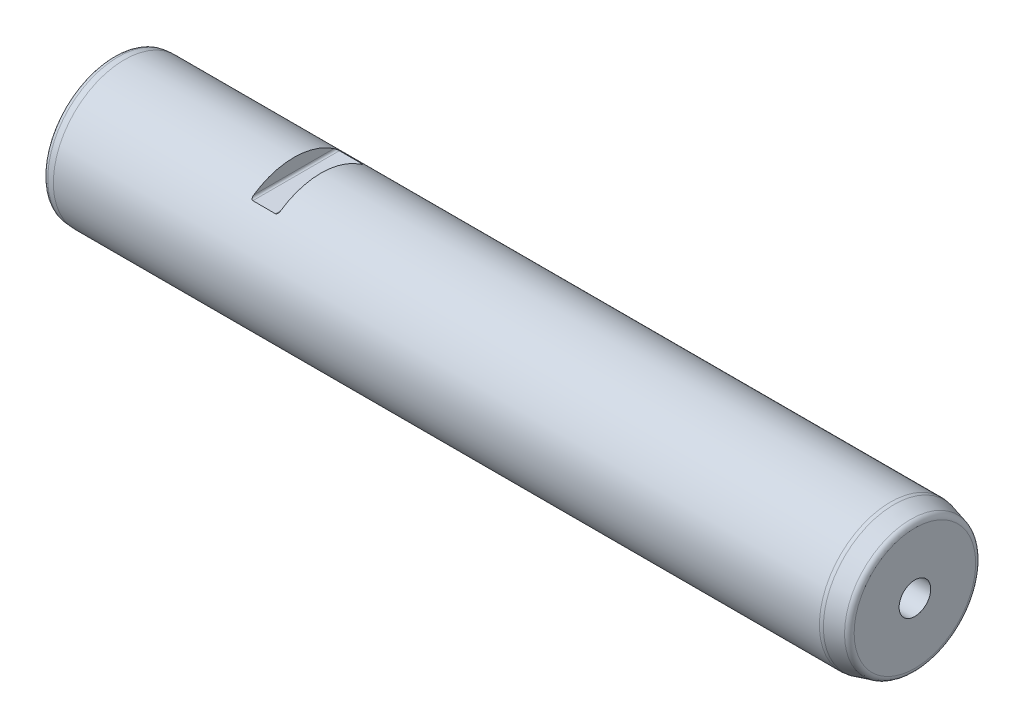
ISO-10303-21;
HEADER;
FILE_DESCRIPTION(('STEP AP214'),'2;1');
FILE_NAME('part.step','',(''),(''),'','','');
FILE_SCHEMA(('AUTOMOTIVE_DESIGN { 1 0 10303 214 1 1 1 1 }'));
ENDSEC;
DATA;
#1=APPLICATION_CONTEXT('core data for automotive mechanical design processes');
#2=APPLICATION_PROTOCOL_DEFINITION('international standard','automotive_design',2000,#1);
#3=PRODUCT_CONTEXT('',#1,'mechanical');
#4=PRODUCT('Part','Part','',(#3));
#5=PRODUCT_RELATED_PRODUCT_CATEGORY('part','',(#4));
#6=PRODUCT_DEFINITION_FORMATION('','',#4);
#7=PRODUCT_DEFINITION_CONTEXT('part definition',#1,'design');
#8=PRODUCT_DEFINITION('design','',#6,#7);
#9=PRODUCT_DEFINITION_SHAPE('','',#8);
#10=(LENGTH_UNIT() NAMED_UNIT(*) SI_UNIT(.MILLI.,.METRE.));
#11=(NAMED_UNIT(*) PLANE_ANGLE_UNIT() SI_UNIT($,.RADIAN.));
#12=(NAMED_UNIT(*) SI_UNIT($,.STERADIAN.) SOLID_ANGLE_UNIT());
#13=UNCERTAINTY_MEASURE_WITH_UNIT(LENGTH_MEASURE(1.E-05),#10,'distance_accuracy_value','');
#14=(GEOMETRIC_REPRESENTATION_CONTEXT(3) GLOBAL_UNCERTAINTY_ASSIGNED_CONTEXT((#13)) GLOBAL_UNIT_ASSIGNED_CONTEXT((#10,
#11,#12)) REPRESENTATION_CONTEXT('',''));
#15=CARTESIAN_POINT('',(0.,0.,0.));
#16=DIRECTION('',(0.,0.,1.));
#17=DIRECTION('',(1.,0.,0.));
#18=AXIS2_PLACEMENT_3D('',#15,#16,#17);
#19=CARTESIAN_POINT('',(0.,0.,0.));
#20=DIRECTION('',(1.,0.,0.));
#21=DIRECTION('',(0.,0.,-1.));
#22=AXIS2_PLACEMENT_3D('',#19,#20,#21);
#23=PLANE('',#22);
#24=CARTESIAN_POINT('',(0.,0.,0.));
#25=DIRECTION('',(1.,0.,0.));
#26=DIRECTION('',(0.,0.,-1.));
#27=AXIS2_PLACEMENT_3D('',#24,#25,#26);
#28=CIRCLE('',#27,28.7717287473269);
#29=CARTESIAN_POINT('',(0.,0.,-28.7717287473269));
#30=VERTEX_POINT('',#29);
#31=EDGE_CURVE('E160',#30,#30,#28,.F.);
#32=ORIENTED_EDGE('',*,*,#31,.T.);
#33=EDGE_LOOP('',(#32));
#34=FACE_BOUND('',#33,.T.);
#35=ADVANCED_FACE('F15',(#34),#23,.F.);
#36=CARTESIAN_POINT('',(0.,0.,0.));
#37=DIRECTION('',(-1.,0.,0.));
#38=DIRECTION('',(0.,0.,1.));
#39=AXIS2_PLACEMENT_3D('',#36,#37,#38);
#40=CYLINDRICAL_SURFACE('',#39,31.5);
#41=CARTESIAN_POINT('',(91.,25.,-19.1637678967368));
#42=CARTESIAN_POINT('',(91.0206021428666,24.9999962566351,-19.1637724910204));
#43=CARTESIAN_POINT('',(91.0411895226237,25.000637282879,-19.1629365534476));
#44=CARTESIAN_POINT('',(91.0821323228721,25.0031684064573,-19.1596340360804));
#45=CARTESIAN_POINT('',(91.1024879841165,25.0050570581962,-19.1571693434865));
#46=CARTESIAN_POINT('',(91.1624864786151,25.0124756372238,-19.1474836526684));
#47=CARTESIAN_POINT('',(91.2015690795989,25.0197603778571,-19.1379682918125));
#48=CARTESIAN_POINT('',(91.2768030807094,25.0382921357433,-19.1137163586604));
#49=CARTESIAN_POINT('',(91.3129662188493,25.0495222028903,-19.0990021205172));
#50=CARTESIAN_POINT('',(91.3821411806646,25.0751576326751,-19.0653329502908));
#51=CARTESIAN_POINT('',(91.4151429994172,25.0895726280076,-19.0463651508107));
#52=CARTESIAN_POINT('',(91.4940924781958,25.1289598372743,-18.9943915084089));
#53=CARTESIAN_POINT('',(91.5378167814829,25.1555174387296,-18.9592231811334));
#54=CARTESIAN_POINT('',(91.6178752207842,25.2121909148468,-18.8837940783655));
#55=CARTESIAN_POINT('',(91.654194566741,25.2423137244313,-18.8435233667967));
#56=CARTESIAN_POINT('',(91.7400427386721,25.323512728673,-18.7343708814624));
#57=CARTESIAN_POINT('',(91.7844613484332,25.3763362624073,-18.6627946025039));
#58=CARTESIAN_POINT('',(91.8595737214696,25.4847393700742,-18.5144966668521));
#59=CARTESIAN_POINT('',(91.8902090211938,25.5403295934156,-18.437754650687));
#60=CARTESIAN_POINT('',(91.9297784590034,25.6300581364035,-18.3126586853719));
#61=CARTESIAN_POINT('',(91.9424916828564,25.6638849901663,-18.2652250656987));
#62=CARTESIAN_POINT('',(91.963993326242,25.7317021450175,-18.1695608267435));
#63=CARTESIAN_POINT('',(91.9727802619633,25.7656925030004,-18.121329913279));
#64=CARTESIAN_POINT('',(91.9865826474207,25.8331875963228,-18.0249779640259));
#65=CARTESIAN_POINT('',(91.9916469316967,25.866692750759,-17.9768640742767));
#66=CARTESIAN_POINT('',(91.9983485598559,25.9335124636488,-17.8803351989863));
#67=CARTESIAN_POINT('',(91.9999892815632,25.9668271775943,-17.8319205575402));
#68=CARTESIAN_POINT('',(92.,26.,-17.7834192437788));
#69=B_SPLINE_CURVE_WITH_KNOTS('',3,(#41,#42,#43,#44,#45,#46,#47,#48,#49,#50,#51,#52,#53,#54,#55,
#56,#57,#58,#59,#60,#61,#62,#63,#64,#65,#66,#67,#68),.UNSPECIFIED.,.F.,.F.,(4,2,2,2,2,2,2,2,2,2,
2,2,2,4),(0.,0.0617521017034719,0.123432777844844,0.245296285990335,0.366642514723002,
0.488360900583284,0.673551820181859,0.859109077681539,1.15576169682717,1.45366100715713,
1.63242917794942,1.81126485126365,1.98771047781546,2.16398193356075),.UNSPECIFIED.);
#70=CARTESIAN_POINT('',(91.,25.,-19.1637678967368));
#71=VERTEX_POINT('',#70);
#72=CARTESIAN_POINT('',(92.,26.,-17.7834192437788));
#73=VERTEX_POINT('',#72);
#74=EDGE_CURVE('E206',#71,#73,#69,.T.);
#75=ORIENTED_EDGE('',*,*,#74,.T.);
#76=CARTESIAN_POINT('',(92.,0.,0.));
#77=DIRECTION('',(1.,0.,0.));
#78=DIRECTION('',(0.,0.,-1.));
#79=AXIS2_PLACEMENT_3D('',#76,#77,#78);
#80=CIRCLE('',#79,31.5);
#81=CARTESIAN_POINT('',(92.,26.,17.7834192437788));
#82=VERTEX_POINT('',#81);
#83=EDGE_CURVE('E9',#73,#82,#80,.T.);
#84=ORIENTED_EDGE('',*,*,#83,.T.);
#85=CARTESIAN_POINT('',(92.,26.,17.7834192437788));
#86=CARTESIAN_POINT('',(91.9999572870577,25.9536837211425,17.8511416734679));
#87=CARTESIAN_POINT('',(91.9967773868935,25.9070697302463,17.9187190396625));
#88=CARTESIAN_POINT('',(91.98359435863,25.8134163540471,18.0533717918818));
#89=CARTESIAN_POINT('',(91.9735592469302,25.7663759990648,18.1204433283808));
#90=CARTESIAN_POINT('',(91.9459716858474,25.672018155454,18.2538828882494));
#91=CARTESIAN_POINT('',(91.9283458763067,25.6247025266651,18.3202373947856));
#92=CARTESIAN_POINT('',(91.8846961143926,25.5309760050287,18.450628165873));
#93=CARTESIAN_POINT('',(91.8586908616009,25.4845633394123,18.5146692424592));
#94=CARTESIAN_POINT('',(91.8035708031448,25.4032208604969,18.6260588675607));
#95=CARTESIAN_POINT('',(91.7762945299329,25.3679487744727,18.6740601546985));
#96=CARTESIAN_POINT('',(91.7149053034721,25.2992635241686,18.7670081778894));
#97=CARTESIAN_POINT('',(91.6807928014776,25.2658502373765,18.8119551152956));
#98=CARTESIAN_POINT('',(91.6042482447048,25.2016125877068,18.8979268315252));
#99=CARTESIAN_POINT('',(91.5617053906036,25.1708315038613,18.9388871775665));
#100=CARTESIAN_POINT('',(91.4677411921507,25.1144557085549,19.0135816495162));
#101=CARTESIAN_POINT('',(91.4163575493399,25.0888399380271,19.0473451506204));
#102=CARTESIAN_POINT('',(91.3286773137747,25.0549354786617,19.0918997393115));
#103=CARTESIAN_POINT('',(91.2952896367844,25.0439158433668,19.1063475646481));
#104=CARTESIAN_POINT('',(91.2260723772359,25.0252341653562,19.1308099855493));
#105=CARTESIAN_POINT('',(91.1902489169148,25.0175640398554,19.1408352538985));
#106=CARTESIAN_POINT('',(91.1285741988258,25.0079765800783,19.1533587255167));
#107=CARTESIAN_POINT('',(91.1031595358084,25.0050065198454,19.1572353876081));
#108=CARTESIAN_POINT('',(91.0518392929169,25.001008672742,19.1624520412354));
#109=CARTESIAN_POINT('',(91.0259323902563,24.9999872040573,19.1637837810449));
#110=CARTESIAN_POINT('',(91.,25.,19.1637678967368));
#111=B_SPLINE_CURVE_WITH_KNOTS('',3,(#85,#86,#87,#88,#89,#90,#91,#92,#93,#94,#95,#96,#97,#98,
#99,#100,#101,#102,#103,#104,#105,#106,#107,#108,#109,#110),.UNSPECIFIED.,.F.,.F.,(4,2,2,2,2,2,
2,2,2,2,2,2,4),(0.,0.2461520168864,0.493460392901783,0.743214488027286,0.992415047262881,
1.18859975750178,1.38477152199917,1.58371665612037,1.78183351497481,1.8954759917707,
2.00884269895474,2.0862906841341,2.16398936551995),.UNSPECIFIED.);
#112=CARTESIAN_POINT('',(91.,25.,19.1637678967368));
#113=VERTEX_POINT('',#112);
#114=EDGE_CURVE('E23',#82,#113,#111,.T.);
#115=ORIENTED_EDGE('',*,*,#114,.T.);
#116=DIRECTION('',(-1.,0.,0.));
#117=VECTOR('',#116,1.);
#118=CARTESIAN_POINT('',(0.,25.,19.1637678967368));
#119=LINE('',#118,#117);
#120=CARTESIAN_POINT('',(81.,25.,19.1637678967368));
#121=VERTEX_POINT('',#120);
#122=EDGE_CURVE('E74',#113,#121,#119,.T.);
#123=ORIENTED_EDGE('',*,*,#122,.T.);
#124=CARTESIAN_POINT('',(81.,25.,19.1637678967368));
#125=CARTESIAN_POINT('',(80.9793978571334,24.9999962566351,19.1637724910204));
#126=CARTESIAN_POINT('',(80.9588104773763,25.000637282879,19.1629365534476));
#127=CARTESIAN_POINT('',(80.9178676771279,25.0031684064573,19.1596340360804));
#128=CARTESIAN_POINT('',(80.8975120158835,25.0050570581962,19.1571693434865));
#129=CARTESIAN_POINT('',(80.8375135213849,25.0124756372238,19.1474836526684));
#130=CARTESIAN_POINT('',(80.7984309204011,25.0197603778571,19.1379682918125));
#131=CARTESIAN_POINT('',(80.7231969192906,25.0382921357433,19.1137163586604));
#132=CARTESIAN_POINT('',(80.6870337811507,25.0495222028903,19.0990021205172));
#133=CARTESIAN_POINT('',(80.6178588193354,25.0751576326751,19.0653329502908));
#134=CARTESIAN_POINT('',(80.5848570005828,25.0895726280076,19.0463651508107));
#135=CARTESIAN_POINT('',(80.5059075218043,25.1289598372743,18.9943915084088));
#136=CARTESIAN_POINT('',(80.4621832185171,25.1555174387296,18.9592231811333));
#137=CARTESIAN_POINT('',(80.3821247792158,25.2121909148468,18.8837940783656));
#138=CARTESIAN_POINT('',(80.345805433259,25.2423137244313,18.8435233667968));
#139=CARTESIAN_POINT('',(80.2599572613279,25.3235127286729,18.7343708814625));
#140=CARTESIAN_POINT('',(80.2155386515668,25.3763362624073,18.662794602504));
#141=CARTESIAN_POINT('',(80.1404262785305,25.4847393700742,18.5144966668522));
#142=CARTESIAN_POINT('',(80.1097909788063,25.5403295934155,18.437754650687));
#143=CARTESIAN_POINT('',(80.0702215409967,25.6300581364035,18.3126586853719));
#144=CARTESIAN_POINT('',(80.0575083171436,25.6638849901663,18.2652250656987));
#145=CARTESIAN_POINT('',(80.0360066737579,25.7317021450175,18.1695608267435));
#146=CARTESIAN_POINT('',(80.0272197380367,25.7656925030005,18.121329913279));
#147=CARTESIAN_POINT('',(80.0134173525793,25.8331875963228,18.0249779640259));
#148=CARTESIAN_POINT('',(80.0083530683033,25.866692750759,17.9768640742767));
#149=CARTESIAN_POINT('',(80.0016514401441,25.9335124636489,17.8803351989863));
#150=CARTESIAN_POINT('',(80.0000107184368,25.9668271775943,17.8319205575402));
#151=CARTESIAN_POINT('',(80.,26.,17.7834192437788));
#152=B_SPLINE_CURVE_WITH_KNOTS('',3,(#124,#125,#126,#127,#128,#129,#130,#131,#132,#133,#134,
#135,#136,#137,#138,#139,#140,#141,#142,#143,#144,#145,#146,#147,#148,#149,#150,#151),
.UNSPECIFIED.,.F.,.F.,(4,2,2,2,2,2,2,2,2,2,2,2,2,4),(0.,0.061752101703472,0.123432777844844,
0.245296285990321,0.366642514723,0.488360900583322,0.673551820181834,0.859109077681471,
1.15576169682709,1.45366100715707,1.6324291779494,1.81126485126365,1.98771047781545,
2.16398193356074),.UNSPECIFIED.);
#153=CARTESIAN_POINT('',(80.,26.,17.7834192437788));
#154=VERTEX_POINT('',#153);
#155=EDGE_CURVE('E65',#121,#154,#152,.T.);
#156=ORIENTED_EDGE('',*,*,#155,.T.);
#157=CARTESIAN_POINT('',(80.,0.,0.));
#158=DIRECTION('',(-1.,0.,0.));
#159=DIRECTION('',(0.,-1.,0.));
#160=AXIS2_PLACEMENT_3D('',#157,#158,#159);
#161=CIRCLE('',#160,31.5);
#162=CARTESIAN_POINT('',(80.,26.,-17.7834192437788));
#163=VERTEX_POINT('',#162);
#164=EDGE_CURVE('E54',#154,#163,#161,.T.);
#165=ORIENTED_EDGE('',*,*,#164,.T.);
#166=CARTESIAN_POINT('',(80.,26.,-17.7834192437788));
#167=CARTESIAN_POINT('',(80.0000427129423,25.9536837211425,-17.8511416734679));
#168=CARTESIAN_POINT('',(80.0032226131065,25.9070697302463,-17.9187190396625));
#169=CARTESIAN_POINT('',(80.01640564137,25.8134163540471,-18.0533717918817));
#170=CARTESIAN_POINT('',(80.0264407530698,25.7663759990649,-18.1204433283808));
#171=CARTESIAN_POINT('',(80.0540283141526,25.672018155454,-18.2538828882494));
#172=CARTESIAN_POINT('',(80.0716541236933,25.6247025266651,-18.3202373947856));
#173=CARTESIAN_POINT('',(80.1153038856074,25.5309760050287,-18.450628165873));
#174=CARTESIAN_POINT('',(80.1413091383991,25.4845633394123,-18.5146692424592));
#175=CARTESIAN_POINT('',(80.1964291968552,25.4032208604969,-18.6260588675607));
#176=CARTESIAN_POINT('',(80.2237054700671,25.3679487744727,-18.6740601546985));
#177=CARTESIAN_POINT('',(80.2850946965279,25.2992635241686,-18.7670081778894));
#178=CARTESIAN_POINT('',(80.3192071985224,25.2658502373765,-18.8119551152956));
#179=CARTESIAN_POINT('',(80.3957517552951,25.2016125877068,-18.8979268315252));
#180=CARTESIAN_POINT('',(80.4382946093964,25.1708315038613,-18.9388871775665));
#181=CARTESIAN_POINT('',(80.5322588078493,25.1144557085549,-19.0135816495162));
#182=CARTESIAN_POINT('',(80.5836424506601,25.0888399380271,-19.0473451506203));
#183=CARTESIAN_POINT('',(80.6713226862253,25.0549354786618,-19.0918997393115));
#184=CARTESIAN_POINT('',(80.7047103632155,25.0439158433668,-19.106347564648));
#185=CARTESIAN_POINT('',(80.7739276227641,25.0252341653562,-19.1308099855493));
#186=CARTESIAN_POINT('',(80.8097510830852,25.0175640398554,-19.1408352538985));
#187=CARTESIAN_POINT('',(80.8714258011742,25.0079765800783,-19.1533587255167));
#188=CARTESIAN_POINT('',(80.8968404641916,25.0050065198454,-19.1572353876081));
#189=CARTESIAN_POINT('',(80.9481607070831,25.001008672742,-19.1624520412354));
#190=CARTESIAN_POINT('',(80.9740676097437,24.9999872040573,-19.1637837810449));
#191=CARTESIAN_POINT('',(81.,25.,-19.1637678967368));
#192=B_SPLINE_CURVE_WITH_KNOTS('',3,(#166,#167,#168,#169,#170,#171,#172,#173,#174,#175,#176,
#177,#178,#179,#180,#181,#182,#183,#184,#185,#186,#187,#188,#189,#190,#191),.UNSPECIFIED.,.F.,
.F.,(4,2,2,2,2,2,2,2,2,2,2,2,4),(0.,0.246152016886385,0.493460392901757,0.743214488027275,
0.992415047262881,1.18859975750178,1.38477152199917,1.58371665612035,1.78183351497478,
1.89547599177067,2.00884269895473,2.08629068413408,2.16398936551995),.UNSPECIFIED.);
#193=CARTESIAN_POINT('',(81.,25.,-19.1637678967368));
#194=VERTEX_POINT('',#193);
#195=EDGE_CURVE('E59',#163,#194,#192,.T.);
#196=ORIENTED_EDGE('',*,*,#195,.T.);
#197=DIRECTION('',(-1.,0.,0.));
#198=VECTOR('',#197,1.);
#199=CARTESIAN_POINT('',(0.,25.,-19.1637678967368));
#200=LINE('',#199,#198);
#201=EDGE_CURVE('E75',#194,#71,#200,.F.);
#202=ORIENTED_EDGE('',*,*,#201,.T.);
#203=EDGE_LOOP('',(#75,#84,#115,#123,#156,#165,#196,#202));
#204=FACE_BOUND('',#203,.T.);
#205=CARTESIAN_POINT('',(4.99999999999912,0.,0.));
#206=DIRECTION('',(1.,0.,0.));
#207=DIRECTION('',(0.,0.,-1.));
#208=AXIS2_PLACEMENT_3D('',#205,#206,#207);
#209=CIRCLE('',#208,31.5);
#210=CARTESIAN_POINT('',(4.99999999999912,0.,-31.5));
#211=VERTEX_POINT('',#210);
#212=EDGE_CURVE('E159',#211,#211,#209,.T.);
#213=ORIENTED_EDGE('',*,*,#212,.T.);
#214=EDGE_LOOP('',(#213));
#215=FACE_BOUND('',#214,.T.);
#216=CARTESIAN_POINT('',(344.210085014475,0.,0.));
#217=DIRECTION('',(1.,0.,0.));
#218=DIRECTION('',(0.,0.,-1.));
#219=AXIS2_PLACEMENT_3D('',#216,#217,#218);
#220=CIRCLE('',#219,31.5);
#221=CARTESIAN_POINT('',(344.210085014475,0.,-31.5));
#222=VERTEX_POINT('',#221);
#223=EDGE_CURVE('E177',#222,#222,#220,.F.);
#224=ORIENTED_EDGE('',*,*,#223,.T.);
#225=EDGE_LOOP('',(#224));
#226=FACE_BOUND('',#225,.T.);
#227=ADVANCED_FACE('F71',(#204,#215,#226),#40,.T.);
#228=CARTESIAN_POINT('',(355.,0.,0.));
#229=DIRECTION('',(-1.,0.,0.));
#230=DIRECTION('',(0.,0.,1.));
#231=AXIS2_PLACEMENT_3D('',#228,#229,#230);
#232=CONICAL_SURFACE('',#231,28.8205080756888,0.261799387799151);
#233=CARTESIAN_POINT('',(353.147047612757,0.,0.));
#234=DIRECTION('',(1.,0.,0.));
#235=DIRECTION('',(0.,0.,-1.));
#236=AXIS2_PLACEMENT_3D('',#233,#234,#235);
#237=CIRCLE('',#236,29.3170051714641);
#238=CARTESIAN_POINT('',(353.147047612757,0.,-29.3170051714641));
#239=VERTEX_POINT('',#238);
#240=EDGE_CURVE('E165',#239,#239,#237,.F.);
#241=ORIENTED_EDGE('',*,*,#240,.T.);
#242=EDGE_LOOP('',(#241));
#243=FACE_BOUND('',#242,.T.);
#244=CARTESIAN_POINT('',(345.762999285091,0.,0.));
#245=DIRECTION('',(1.,0.,0.));
#246=DIRECTION('',(0.,0.,-1.));
#247=AXIS2_PLACEMENT_3D('',#244,#245,#246);
#248=CIRCLE('',#247,31.2955549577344);
#249=CARTESIAN_POINT('',(345.762999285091,0.,-31.2955549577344));
#250=VERTEX_POINT('',#249);
#251=EDGE_CURVE('E190',#250,#250,#248,.T.);
#252=ORIENTED_EDGE('',*,*,#251,.T.);
#253=EDGE_LOOP('',(#252));
#254=FACE_BOUND('',#253,.T.);
#255=ADVANCED_FACE('F122',(#243,#254),#232,.T.);
#256=CARTESIAN_POINT('',(355.,28.8205080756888,0.));
#257=DIRECTION('',(-1.,0.,0.));
#258=DIRECTION('',(0.,0.,1.));
#259=AXIS2_PLACEMENT_3D('',#256,#257,#258);
#260=PLANE('',#259);
#261=CARTESIAN_POINT('',(355.,0.,0.));
#262=DIRECTION('',(1.,0.,0.));
#263=DIRECTION('',(0.,0.,-1.));
#264=AXIS2_PLACEMENT_3D('',#261,#262,#263);
#265=CIRCLE('',#264,7.);
#266=CARTESIAN_POINT('',(355.,0.,-7.));
#267=VERTEX_POINT('',#266);
#268=EDGE_CURVE('E180',#267,#267,#265,.T.);
#269=ORIENTED_EDGE('',*,*,#268,.F.);
#270=EDGE_LOOP('',(#269));
#271=FACE_BOUND('',#270,.T.);
#272=CARTESIAN_POINT('',(355.,0.,0.));
#273=DIRECTION('',(-1.,0.,0.));
#274=DIRECTION('',(0.,0.,1.));
#275=AXIS2_PLACEMENT_3D('',#272,#273,#274);
#276=CIRCLE('',#275,26.9021906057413);
#277=CARTESIAN_POINT('',(355.,0.,26.9021906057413));
#278=VERTEX_POINT('',#277);
#279=EDGE_CURVE('E161',#278,#278,#276,.F.);
#280=ORIENTED_EDGE('',*,*,#279,.T.);
#281=EDGE_LOOP('',(#280));
#282=FACE_BOUND('',#281,.T.);
#283=ADVANCED_FACE('F119',(#271,#282),#260,.F.);
#284=CARTESIAN_POINT('',(344.210085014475,0.,0.));
#285=DIRECTION('',(1.,0.,0.));
#286=DIRECTION('',(0.,0.,-1.));
#287=AXIS2_PLACEMENT_3D('',#284,#285,#286);
#288=TOROIDAL_SURFACE('',#287,25.5,6.);
#289=ORIENTED_EDGE('',*,*,#251,.F.);
#290=EDGE_LOOP('',(#289));
#291=FACE_BOUND('',#290,.T.);
#292=ORIENTED_EDGE('',*,*,#223,.F.);
#293=EDGE_LOOP('',(#292));
#294=FACE_BOUND('',#293,.T.);
#295=ADVANCED_FACE('F121',(#291,#294),#288,.T.);
#296=CARTESIAN_POINT('',(352.5,0.,0.));
#297=DIRECTION('',(-1.,0.,0.));
#298=DIRECTION('',(0.,0.,1.));
#299=AXIS2_PLACEMENT_3D('',#296,#297,#298);
#300=TOROIDAL_SURFACE('',#299,26.9021906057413,2.5);
#301=ORIENTED_EDGE('',*,*,#279,.F.);
#302=EDGE_LOOP('',(#301));
#303=FACE_BOUND('',#302,.T.);
#304=ORIENTED_EDGE('',*,*,#240,.F.);
#305=EDGE_LOOP('',(#304));
#306=FACE_BOUND('',#305,.T.);
#307=ADVANCED_FACE('F142',(#303,#306),#300,.T.);
#308=CARTESIAN_POINT('',(0.,0.,0.));
#309=DIRECTION('',(1.,0.,0.));
#310=DIRECTION('',(0.,0.,-1.));
#311=AXIS2_PLACEMENT_3D('',#308,#309,#310);
#312=CONICAL_SURFACE('',#311,31.0625566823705,0.0872664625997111);
#313=CARTESIAN_POINT('',(2.28211064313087,0.,0.));
#314=DIRECTION('',(1.,0.,0.));
#315=DIRECTION('',(0.,0.,-1.));
#316=AXIS2_PLACEMENT_3D('',#313,#314,#315);
#317=CIRCLE('',#316,31.2622154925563);
#318=CARTESIAN_POINT('',(2.28211064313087,0.,-31.2622154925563));
#319=VERTEX_POINT('',#318);
#320=EDGE_CURVE('E60',#319,#319,#317,.T.);
#321=ORIENTED_EDGE('',*,*,#320,.T.);
#322=EDGE_LOOP('',(#321));
#323=FACE_BOUND('',#322,.T.);
#324=ORIENTED_EDGE('',*,*,#212,.F.);
#325=EDGE_LOOP('',(#324));
#326=FACE_BOUND('',#325,.T.);
#327=ADVANCED_FACE('F145',(#323,#326),#312,.T.);
#328=CARTESIAN_POINT('',(2.5,0.,0.));
#329=DIRECTION('',(1.,0.,0.));
#330=DIRECTION('',(0.,0.,-1.));
#331=AXIS2_PLACEMENT_3D('',#328,#329,#330);
#332=TOROIDAL_SURFACE('',#331,28.7717287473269,2.5);
#333=ORIENTED_EDGE('',*,*,#320,.F.);
#334=EDGE_LOOP('',(#333));
#335=FACE_BOUND('',#334,.T.);
#336=ORIENTED_EDGE('',*,*,#31,.F.);
#337=EDGE_LOOP('',(#336));
#338=FACE_BOUND('',#337,.T.);
#339=ADVANCED_FACE('F17',(#335,#338),#332,.T.);
#340=CARTESIAN_POINT('',(331.,0.,0.));
#341=DIRECTION('',(1.,0.,0.));
#342=DIRECTION('',(0.,0.,-1.));
#343=AXIS2_PLACEMENT_3D('',#340,#341,#342);
#344=PLANE('',#343);
#345=CARTESIAN_POINT('',(331.,0.,0.));
#346=DIRECTION('',(1.,0.,0.));
#347=DIRECTION('',(0.,0.,-1.));
#348=AXIS2_PLACEMENT_3D('',#345,#346,#347);
#349=CIRCLE('',#348,7.);
#350=CARTESIAN_POINT('',(331.,0.,-7.));
#351=VERTEX_POINT('',#350);
#352=EDGE_CURVE('E173',#351,#351,#349,.T.);
#353=ORIENTED_EDGE('',*,*,#352,.T.);
#354=EDGE_LOOP('',(#353));
#355=FACE_BOUND('',#354,.T.);
#356=CARTESIAN_POINT('',(331.,0.,0.));
#357=DIRECTION('',(1.,0.,0.));
#358=DIRECTION('',(0.,0.,-1.));
#359=AXIS2_PLACEMENT_3D('',#356,#357,#358);
#360=CIRCLE('',#359,5.1);
#361=CARTESIAN_POINT('',(331.,0.,-5.1));
#362=VERTEX_POINT('',#361);
#363=EDGE_CURVE('E170',#362,#362,#360,.F.);
#364=ORIENTED_EDGE('',*,*,#363,.T.);
#365=EDGE_LOOP('',(#364));
#366=FACE_BOUND('',#365,.T.);
#367=ADVANCED_FACE('F103',(#355,#366),#344,.T.);
#368=CARTESIAN_POINT('',(331.,0.,0.));
#369=DIRECTION('',(1.,0.,0.));
#370=DIRECTION('',(0.,0.,-1.));
#371=AXIS2_PLACEMENT_3D('',#368,#369,#370);
#372=CYLINDRICAL_SURFACE('',#371,7.);
#373=ORIENTED_EDGE('',*,*,#352,.F.);
#374=EDGE_LOOP('',(#373));
#375=FACE_BOUND('',#374,.T.);
#376=ORIENTED_EDGE('',*,*,#268,.T.);
#377=EDGE_LOOP('',(#376));
#378=FACE_BOUND('',#377,.T.);
#379=ADVANCED_FACE('F106',(#375,#378),#372,.F.);
#380=CARTESIAN_POINT('',(325.,0.,0.));
#381=DIRECTION('',(1.,0.,0.));
#382=DIRECTION('',(0.,0.,-1.));
#383=AXIS2_PLACEMENT_3D('',#380,#381,#382);
#384=CONICAL_SURFACE('',#383,5.1,1.0471975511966);
#385=CARTESIAN_POINT('',(322.055513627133,0.,0.));
#386=VERTEX_POINT('',#385);
#387=VERTEX_LOOP('',#386);
#388=FACE_BOUND('',#387,.T.);
#389=CARTESIAN_POINT('',(325.,0.,0.));
#390=DIRECTION('',(1.,0.,0.));
#391=DIRECTION('',(0.,0.,-1.));
#392=AXIS2_PLACEMENT_3D('',#389,#390,#391);
#393=CIRCLE('',#392,5.1);
#394=CARTESIAN_POINT('',(325.,0.,-5.1));
#395=VERTEX_POINT('',#394);
#396=EDGE_CURVE('E172',#395,#395,#393,.T.);
#397=ORIENTED_EDGE('',*,*,#396,.T.);
#398=EDGE_LOOP('',(#397));
#399=FACE_BOUND('',#398,.T.);
#400=ADVANCED_FACE('F110',(#388,#399),#384,.F.);
#401=CARTESIAN_POINT('',(355.,0.,0.));
#402=DIRECTION('',(1.,0.,0.));
#403=DIRECTION('',(0.,0.,-1.));
#404=AXIS2_PLACEMENT_3D('',#401,#402,#403);
#405=CYLINDRICAL_SURFACE('',#404,5.1);
#406=ORIENTED_EDGE('',*,*,#396,.F.);
#407=EDGE_LOOP('',(#406));
#408=FACE_BOUND('',#407,.T.);
#409=ORIENTED_EDGE('',*,*,#363,.F.);
#410=EDGE_LOOP('',(#409));
#411=FACE_BOUND('',#410,.T.);
#412=ADVANCED_FACE('F112',(#408,#411),#405,.F.);
#413=CARTESIAN_POINT('',(92.,26.,-31.5));
#414=DIRECTION('',(1.,0.,0.));
#415=DIRECTION('',(0.,0.,-1.));
#416=AXIS2_PLACEMENT_3D('',#413,#414,#415);
#417=PLANE('',#416);
#418=DIRECTION('',(0.,0.,1.));
#419=VECTOR('',#418,1.);
#420=CARTESIAN_POINT('',(92.,26.,-31.5));
#421=LINE('',#420,#419);
#422=EDGE_CURVE('E184',#73,#82,#421,.T.);
#423=ORIENTED_EDGE('',*,*,#422,.T.);
#424=ORIENTED_EDGE('',*,*,#83,.F.);
#425=EDGE_LOOP('',(#423,#424));
#426=FACE_BOUND('',#425,.T.);
#427=ADVANCED_FACE('F115',(#426),#417,.F.);
#428=CARTESIAN_POINT('',(91.,26.,-31.5));
#429=DIRECTION('',(0.,0.,1.));
#430=DIRECTION('',(1.,0.,0.));
#431=AXIS2_PLACEMENT_3D('',#428,#429,#430);
#432=CYLINDRICAL_SURFACE('',#431,1.);
#433=ORIENTED_EDGE('',*,*,#422,.F.);
#434=ORIENTED_EDGE('',*,*,#74,.F.);
#435=DIRECTION('',(0.,0.,1.));
#436=VECTOR('',#435,1.);
#437=CARTESIAN_POINT('',(91.,25.,-31.5));
#438=LINE('',#437,#436);
#439=EDGE_CURVE('E199',#71,#113,#438,.T.);
#440=ORIENTED_EDGE('',*,*,#439,.T.);
#441=ORIENTED_EDGE('',*,*,#114,.F.);
#442=EDGE_LOOP('',(#433,#434,#440,#441));
#443=FACE_BOUND('',#442,.T.);
#444=ADVANCED_FACE('F217',(#443),#432,.F.);
#445=CARTESIAN_POINT('',(81.,25.,-31.5));
#446=DIRECTION('',(0.,-1.,0.));
#447=DIRECTION('',(0.,0.,-1.));
#448=AXIS2_PLACEMENT_3D('',#445,#446,#447);
#449=PLANE('',#448);
#450=ORIENTED_EDGE('',*,*,#439,.F.);
#451=ORIENTED_EDGE('',*,*,#201,.F.);
#452=DIRECTION('',(0.,0.,1.));
#453=VECTOR('',#452,1.);
#454=CARTESIAN_POINT('',(81.,25.,-31.5));
#455=LINE('',#454,#453);
#456=EDGE_CURVE('E67',#194,#121,#455,.T.);
#457=ORIENTED_EDGE('',*,*,#456,.T.);
#458=ORIENTED_EDGE('',*,*,#122,.F.);
#459=EDGE_LOOP('',(#450,#451,#457,#458));
#460=FACE_BOUND('',#459,.T.);
#461=ADVANCED_FACE('F98',(#460),#449,.F.);
#462=CARTESIAN_POINT('',(81.,26.,-31.5));
#463=DIRECTION('',(0.,0.,1.));
#464=DIRECTION('',(1.,0.,0.));
#465=AXIS2_PLACEMENT_3D('',#462,#463,#464);
#466=CYLINDRICAL_SURFACE('',#465,1.);
#467=ORIENTED_EDGE('',*,*,#456,.F.);
#468=ORIENTED_EDGE('',*,*,#195,.F.);
#469=DIRECTION('',(0.,0.,1.));
#470=VECTOR('',#469,1.);
#471=CARTESIAN_POINT('',(80.,26.,-31.5));
#472=LINE('',#471,#470);
#473=EDGE_CURVE('E29',#163,#154,#472,.T.);
#474=ORIENTED_EDGE('',*,*,#473,.T.);
#475=ORIENTED_EDGE('',*,*,#155,.F.);
#476=EDGE_LOOP('',(#467,#468,#474,#475));
#477=FACE_BOUND('',#476,.T.);
#478=ADVANCED_FACE('F64',(#477),#466,.F.);
#479=CARTESIAN_POINT('',(80.,31.5,-31.5));
#480=DIRECTION('',(-1.,0.,0.));
#481=DIRECTION('',(0.,-1.,0.));
#482=AXIS2_PLACEMENT_3D('',#479,#480,#481);
#483=PLANE('',#482);
#484=ORIENTED_EDGE('',*,*,#473,.F.);
#485=ORIENTED_EDGE('',*,*,#164,.F.);
#486=EDGE_LOOP('',(#484,#485));
#487=FACE_BOUND('',#486,.T.);
#488=ADVANCED_FACE('F55',(#487),#483,.F.);
#489=CLOSED_SHELL('',(#35,#227,#255,#283,#295,#307,#327,#339,#367,#379,#400,#412,#427,#444,#461,
#478,#488));
#490=MANIFOLD_SOLID_BREP('B1',#489);
#491=ADVANCED_BREP_SHAPE_REPRESENTATION('',(#18,#490),#14);
#492=SHAPE_DEFINITION_REPRESENTATION(#9,#491);
ENDSEC;
END-ISO-10303-21;
